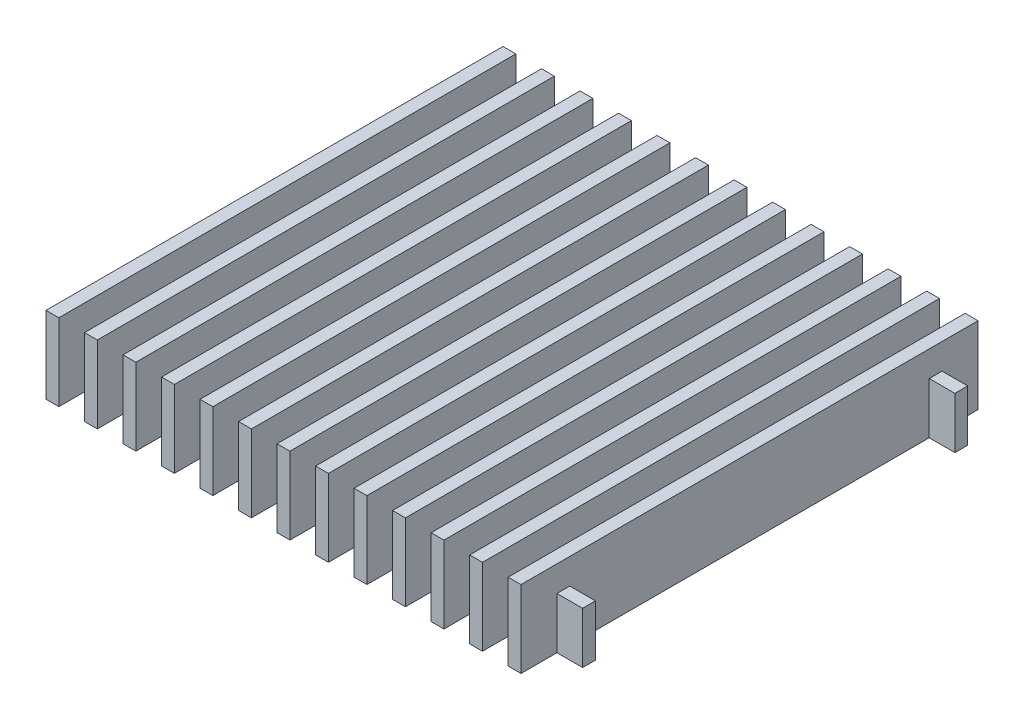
from build123d import *

# Parameters (mm, degrees)
SKETCH2_W              = 3.175
SKETCH2_H              = 113.03
BOSS_EXTRUDE1_DEPTH    = 9.525
BOSS_EXTRUDE1_2_DEPTH  = 9.525
BOSS_EXTRUDE1_3_DEPTH  = 9.525
BOSS_EXTRUDE1_4_DEPTH  = 9.525
BOSS_EXTRUDE1_5_DEPTH  = 9.525
BOSS_EXTRUDE1_6_DEPTH  = 9.525
BOSS_EXTRUDE1_7_DEPTH  = 9.525
BOSS_EXTRUDE1_8_DEPTH  = 9.525
BOSS_EXTRUDE1_9_DEPTH  = 9.525
BOSS_EXTRUDE1_10_DEPTH = 9.525
BOSS_EXTRUDE1_11_DEPTH = 9.525
BOSS_EXTRUDE1_12_DEPTH = 9.525
BOSS_EXTRUDE1_13_DEPTH = 9.525
SKETCH3_W              = 130.175
SKETCH3_H              = 3.175
BOSS_EXTRUDE2_DEPTH    = 12.7


with BuildPart() as part:
    # Sketch2 → Boss-Extrude1 (new, symmetric)
    with BuildSketch(Plane(origin=(0, 0, 0), x_dir=(1, 0, 0), z_dir=(0, 1, 0))):
        with Locations((-47.625, 0)):
            Rectangle(SKETCH2_W, SKETCH2_H)
    extrude(amount=BOSS_EXTRUDE1_DEPTH, both=True)



with BuildPart() as body_2:
    # Sketch2 → Boss-Extrude1 2 (new, symmetric)
    with BuildSketch(Plane(origin=(0, 0, 0), x_dir=(1, 0, 0), z_dir=(0, 1, 0))):
        with Locations((-57.15, 0)):
            Rectangle(SKETCH2_W, SKETCH2_H)
    extrude(amount=BOSS_EXTRUDE1_2_DEPTH, both=True)


with BuildPart() as body_3:
    # Sketch2 → Boss-Extrude1 3 (new, symmetric)
    with BuildSketch(Plane(origin=(0, 0, 0), x_dir=(1, 0, 0), z_dir=(0, 1, 0))):
        with Locations((-38.1, 0)):
            Rectangle(SKETCH2_W, SKETCH2_H)
    extrude(amount=BOSS_EXTRUDE1_3_DEPTH, both=True)


with BuildPart() as body_4:
    # Sketch2 → Boss-Extrude1 4 (new, symmetric)
    with BuildSketch(Plane(origin=(0, 0, 0), x_dir=(1, 0, 0), z_dir=(0, 1, 0))):
        with Locations((-28.575, 0)):
            Rectangle(SKETCH2_W, SKETCH2_H)
    extrude(amount=BOSS_EXTRUDE1_4_DEPTH, both=True)


with BuildPart() as body_5:
    # Sketch2 → Boss-Extrude1 5 (new, symmetric)
    with BuildSketch(Plane(origin=(0, 0, 0), x_dir=(1, 0, 0), z_dir=(0, 1, 0))):
        with Locations((-19.05, 0)):
            Rectangle(SKETCH2_W, SKETCH2_H)
    extrude(amount=BOSS_EXTRUDE1_5_DEPTH, both=True)


with BuildPart() as body_6:
    # Sketch2 → Boss-Extrude1 6 (new, symmetric)
    with BuildSketch(Plane(origin=(0, 0, 0), x_dir=(1, 0, 0), z_dir=(0, 1, 0))):
        with Locations((-9.525, 0)):
            Rectangle(SKETCH2_W, SKETCH2_H)
    extrude(amount=BOSS_EXTRUDE1_6_DEPTH, both=True)


with BuildPart() as body_7:
    # Sketch2 → Boss-Extrude1 7 (new, symmetric)
    with BuildSketch(Plane(origin=(0, 0, 0), x_dir=(1, 0, 0), z_dir=(0, 1, 0))):
        Rectangle(SKETCH2_W, SKETCH2_H)
    extrude(amount=BOSS_EXTRUDE1_7_DEPTH, both=True)


with BuildPart() as body_8:
    # Sketch2 → Boss-Extrude1 8 (new, symmetric)
    with BuildSketch(Plane(origin=(0, 0, 0), x_dir=(1, 0, 0), z_dir=(0, 1, 0))):
        with Locations((9.525, 0)):
            Rectangle(SKETCH2_W, SKETCH2_H)
    extrude(amount=BOSS_EXTRUDE1_8_DEPTH, both=True)


with BuildPart() as body_9:
    # Sketch2 → Boss-Extrude1 9 (new, symmetric)
    with BuildSketch(Plane(origin=(0, 0, 0), x_dir=(1, 0, 0), z_dir=(0, 1, 0))):
        with Locations((19.05, 0)):
            Rectangle(SKETCH2_W, SKETCH2_H)
    extrude(amount=BOSS_EXTRUDE1_9_DEPTH, both=True)


with BuildPart() as body_10:
    # Sketch2 → Boss-Extrude1 10 (new, symmetric)
    with BuildSketch(Plane(origin=(0, 0, 0), x_dir=(1, 0, 0), z_dir=(0, 1, 0))):
        with Locations((28.575, 0)):
            Rectangle(SKETCH2_W, SKETCH2_H)
    extrude(amount=BOSS_EXTRUDE1_10_DEPTH, both=True)


with BuildPart() as body_11:
    # Sketch2 → Boss-Extrude1 11 (new, symmetric)
    with BuildSketch(Plane(origin=(0, 0, 0), x_dir=(1, 0, 0), z_dir=(0, 1, 0))):
        with Locations((38.1, 0)):
            Rectangle(SKETCH2_W, SKETCH2_H)
    extrude(amount=BOSS_EXTRUDE1_11_DEPTH, both=True)


with BuildPart() as body_12:
    # Sketch2 → Boss-Extrude1 12 (new, symmetric)
    with BuildSketch(Plane(origin=(0, 0, 0), x_dir=(1, 0, 0), z_dir=(0, 1, 0))):
        with Locations((47.625, 0)):
            Rectangle(SKETCH2_W, SKETCH2_H)
    extrude(amount=BOSS_EXTRUDE1_12_DEPTH, both=True)


with BuildPart() as body_13:
    # Sketch2 → Boss-Extrude1 13 (new, symmetric)
    with BuildSketch(Plane(origin=(0, 0, 0), x_dir=(1, 0, 0), z_dir=(0, 1, 0))):
        with Locations((57.15, 0)):
            Rectangle(SKETCH2_W, SKETCH2_H)
    extrude(amount=BOSS_EXTRUDE1_13_DEPTH, both=True)


with BuildPart() as part_1:
    add(part.part)

    add(body_2.part)  # Boss-Extrude2 merges body 2

    add(body_3.part)  # Boss-Extrude2 merges body 3

    add(body_4.part)  # Boss-Extrude2 merges body 4

    add(body_5.part)  # Boss-Extrude2 merges body 5

    add(body_6.part)  # Boss-Extrude2 merges body 6

    add(body_7.part)  # Boss-Extrude2 merges body 7

    add(body_8.part)  # Boss-Extrude2 merges body 8

    add(body_9.part)  # Boss-Extrude2 merges body 9

    add(body_10.part)  # Boss-Extrude2 merges body 10

    add(body_11.part)  # Boss-Extrude2 merges body 11

    add(body_12.part)  # Boss-Extrude2 merges body 12

    add(body_13.part)  # Boss-Extrude2 merges body 13
    # Sketch3 → Boss-Extrude2 (add)
    with BuildSketch(Plane.XZ.offset(9.525)):
        with Locations((0, 46.0375)):
            Rectangle(SKETCH3_W, SKETCH3_H)
        with Locations((0, -46.0375)):
            Rectangle(SKETCH3_W, SKETCH3_H)
    extrude(amount=-BOSS_EXTRUDE2_DEPTH)


solid = part_1.part
